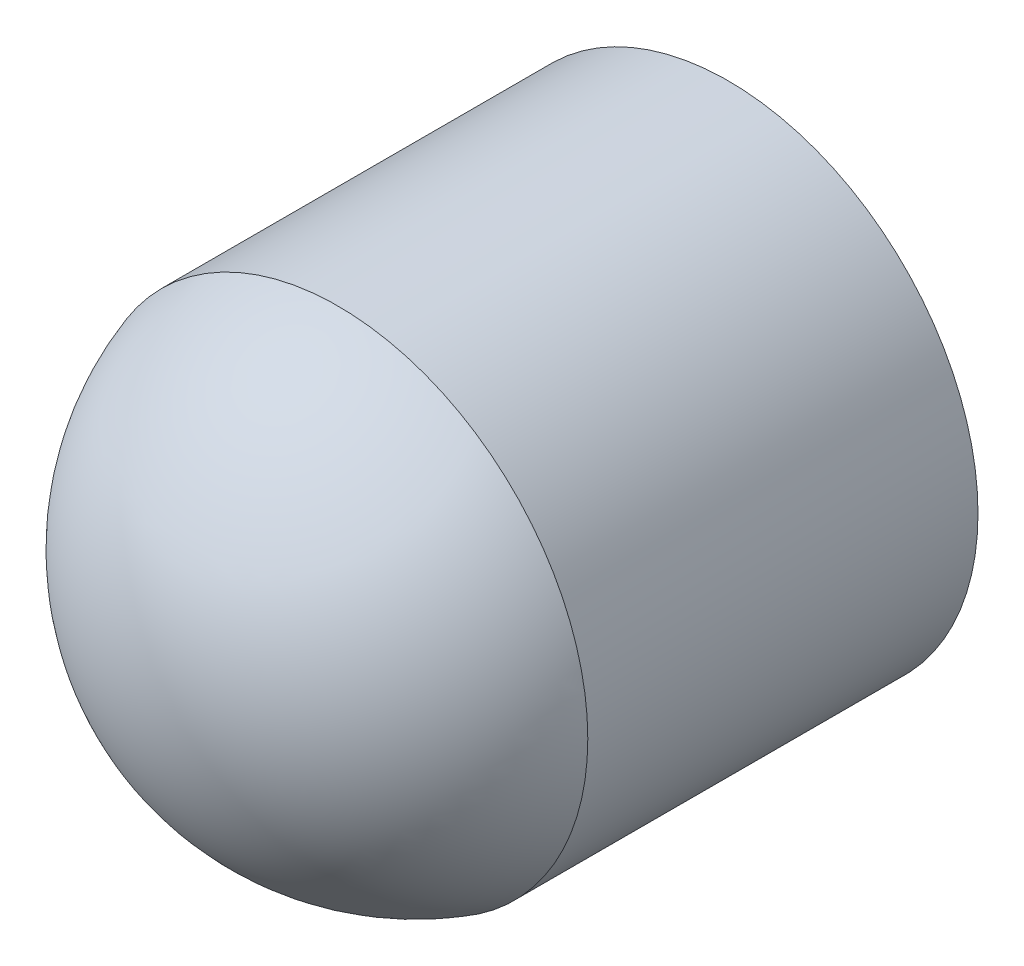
ISO-10303-21;
HEADER;
FILE_DESCRIPTION(('STEP AP214'),'2;1');
FILE_NAME('part.step','',(''),(''),'','','');
FILE_SCHEMA(('AUTOMOTIVE_DESIGN { 1 0 10303 214 1 1 1 1 }'));
ENDSEC;
DATA;
#1=APPLICATION_CONTEXT('core data for automotive mechanical design processes');
#2=APPLICATION_PROTOCOL_DEFINITION('international standard','automotive_design',2000,#1);
#3=PRODUCT_CONTEXT('',#1,'mechanical');
#4=PRODUCT('Part','Part','',(#3));
#5=PRODUCT_RELATED_PRODUCT_CATEGORY('part','',(#4));
#6=PRODUCT_DEFINITION_FORMATION('','',#4);
#7=PRODUCT_DEFINITION_CONTEXT('part definition',#1,'design');
#8=PRODUCT_DEFINITION('design','',#6,#7);
#9=PRODUCT_DEFINITION_SHAPE('','',#8);
#10=(LENGTH_UNIT() NAMED_UNIT(*) SI_UNIT(.MILLI.,.METRE.));
#11=(NAMED_UNIT(*) PLANE_ANGLE_UNIT() SI_UNIT($,.RADIAN.));
#12=(NAMED_UNIT(*) SI_UNIT($,.STERADIAN.) SOLID_ANGLE_UNIT());
#13=UNCERTAINTY_MEASURE_WITH_UNIT(LENGTH_MEASURE(1.E-05),#10,'distance_accuracy_value','');
#14=(GEOMETRIC_REPRESENTATION_CONTEXT(3) GLOBAL_UNCERTAINTY_ASSIGNED_CONTEXT((#13)) GLOBAL_UNIT_ASSIGNED_CONTEXT((#10,
#11,#12)) REPRESENTATION_CONTEXT('',''));
#15=CARTESIAN_POINT('',(0.,0.,0.));
#16=DIRECTION('',(0.,0.,1.));
#17=DIRECTION('',(1.,0.,0.));
#18=AXIS2_PLACEMENT_3D('',#15,#16,#17);
#19=CARTESIAN_POINT('',(0.,0.,-0.716));
#20=DIRECTION('',(0.,0.,1.));
#21=DIRECTION('',(0.,-1.,0.));
#22=AXIS2_PLACEMENT_3D('',#19,#20,#21);
#23=SPHERICAL_SURFACE('',#22,2.2);
#24=CARTESIAN_POINT('',(0.,0.,-0.0602561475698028));
#25=DIRECTION('',(0.,0.,-1.));
#26=DIRECTION('',(-1.,0.,0.));
#27=AXIS2_PLACEMENT_3D('',#24,#25,#26);
#28=CIRCLE('',#27,2.1);
#29=CARTESIAN_POINT('',(2.1,0.,-0.060256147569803));
#30=VERTEX_POINT('',#29);
#31=EDGE_CURVE('E11',#30,#30,#28,.F.);
#32=ORIENTED_EDGE('',*,*,#31,.T.);
#33=EDGE_LOOP('',(#32));
#34=FACE_BOUND('',#33,.T.);
#35=ADVANCED_FACE('F31',(#34),#23,.T.);
#36=CARTESIAN_POINT('',(0.,0.,-3.34084565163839));
#37=DIRECTION('',(0.,0.,1.));
#38=DIRECTION('',(1.,0.,0.));
#39=AXIS2_PLACEMENT_3D('',#36,#37,#38);
#40=CYLINDRICAL_SURFACE('',#39,2.1);
#41=CARTESIAN_POINT('',(0.,0.,-3.34084565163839));
#42=DIRECTION('',(0.,0.,1.));
#43=DIRECTION('',(1.,0.,0.));
#44=AXIS2_PLACEMENT_3D('',#41,#42,#43);
#45=CIRCLE('',#44,2.1);
#46=CARTESIAN_POINT('',(2.1,0.,-3.34084565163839));
#47=VERTEX_POINT('',#46);
#48=EDGE_CURVE('E38',#47,#47,#45,.T.);
#49=CARTESIAN_POINT('',(2.1,0.,-0.060256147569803));
#50=CARTESIAN_POINT('',(2.1,0.,-0.0944289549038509));
#51=CARTESIAN_POINT('',(2.1,0.,-0.128601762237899));
#52=CARTESIAN_POINT('',(2.1,0.,-0.196947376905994));
#53=CARTESIAN_POINT('',(2.1,0.,-0.231120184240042));
#54=CARTESIAN_POINT('',(2.1,0.,-0.299465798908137));
#55=CARTESIAN_POINT('',(2.1,0.,-0.333638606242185));
#56=CARTESIAN_POINT('',(2.1,0.,-0.401984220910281));
#57=CARTESIAN_POINT('',(2.1,0.,-0.436157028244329));
#58=CARTESIAN_POINT('',(2.1,0.,-0.504502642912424));
#59=CARTESIAN_POINT('',(2.1,0.,-0.538675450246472));
#60=CARTESIAN_POINT('',(2.1,0.,-0.607021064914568));
#61=CARTESIAN_POINT('',(2.1,0.,-0.641193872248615));
#62=CARTESIAN_POINT('',(2.1,0.,-0.709539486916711));
#63=CARTESIAN_POINT('',(2.1,0.,-0.743712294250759));
#64=CARTESIAN_POINT('',(2.1,0.,-0.812057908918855));
#65=CARTESIAN_POINT('',(2.1,0.,-0.846230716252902));
#66=CARTESIAN_POINT('',(2.1,0.,-0.914576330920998));
#67=CARTESIAN_POINT('',(2.1,0.,-0.948749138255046));
#68=CARTESIAN_POINT('',(2.1,0.,-1.01709475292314));
#69=CARTESIAN_POINT('',(2.1,0.,-1.05126756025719));
#70=CARTESIAN_POINT('',(2.1,0.,-1.11961317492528));
#71=CARTESIAN_POINT('',(2.1,0.,-1.15378598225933));
#72=CARTESIAN_POINT('',(2.1,0.,-1.22213159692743));
#73=CARTESIAN_POINT('',(2.1,0.,-1.25630440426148));
#74=CARTESIAN_POINT('',(2.1,0.,-1.32465001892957));
#75=CARTESIAN_POINT('',(2.1,0.,-1.35882282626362));
#76=CARTESIAN_POINT('',(2.1,0.,-1.42716844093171));
#77=CARTESIAN_POINT('',(2.1,0.,-1.46134124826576));
#78=CARTESIAN_POINT('',(2.1,0.,-1.52968686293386));
#79=CARTESIAN_POINT('',(2.1,0.,-1.56385967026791));
#80=CARTESIAN_POINT('',(2.1,0.,-1.632205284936));
#81=CARTESIAN_POINT('',(2.1,0.,-1.66637809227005));
#82=CARTESIAN_POINT('',(2.1,0.,-1.73472370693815));
#83=CARTESIAN_POINT('',(2.1,0.,-1.76889651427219));
#84=CARTESIAN_POINT('',(2.1,0.,-1.83724212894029));
#85=CARTESIAN_POINT('',(2.1,0.,-1.87141493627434));
#86=CARTESIAN_POINT('',(2.1,0.,-1.93976055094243));
#87=CARTESIAN_POINT('',(2.1,0.,-1.97393335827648));
#88=CARTESIAN_POINT('',(2.1,0.,-2.04227897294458));
#89=CARTESIAN_POINT('',(2.1,0.,-2.07645178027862));
#90=CARTESIAN_POINT('',(2.1,0.,-2.14479739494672));
#91=CARTESIAN_POINT('',(2.1,0.,-2.17897020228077));
#92=CARTESIAN_POINT('',(2.1,0.,-2.24731581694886));
#93=CARTESIAN_POINT('',(2.1,0.,-2.28148862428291));
#94=CARTESIAN_POINT('',(2.1,0.,-2.34983423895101));
#95=CARTESIAN_POINT('',(2.1,0.,-2.38400704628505));
#96=CARTESIAN_POINT('',(2.1,0.,-2.45235266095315));
#97=CARTESIAN_POINT('',(2.1,0.,-2.4865254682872));
#98=CARTESIAN_POINT('',(2.1,0.,-2.55487108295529));
#99=CARTESIAN_POINT('',(2.1,0.,-2.58904389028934));
#100=CARTESIAN_POINT('',(2.1,0.,-2.65738950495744));
#101=CARTESIAN_POINT('',(2.1,0.,-2.69156231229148));
#102=CARTESIAN_POINT('',(2.1,0.,-2.75990792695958));
#103=CARTESIAN_POINT('',(2.1,0.,-2.79408073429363));
#104=CARTESIAN_POINT('',(2.1,0.,-2.86242634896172));
#105=CARTESIAN_POINT('',(2.1,0.,-2.89659915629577));
#106=CARTESIAN_POINT('',(2.1,0.,-2.96494477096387));
#107=CARTESIAN_POINT('',(2.1,0.,-2.99911757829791));
#108=CARTESIAN_POINT('',(2.1,0.,-3.06746319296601));
#109=CARTESIAN_POINT('',(2.1,0.,-3.10163600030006));
#110=CARTESIAN_POINT('',(2.1,0.,-3.16998161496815));
#111=CARTESIAN_POINT('',(2.1,0.,-3.2041544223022));
#112=CARTESIAN_POINT('',(2.1,0.,-3.2725000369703));
#113=CARTESIAN_POINT('',(2.1,0.,-3.30667284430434));
#114=CARTESIAN_POINT('',(2.1,0.,-3.34084565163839));
#115=B_SPLINE_CURVE_WITH_KNOTS('',3,(#49,#50,#51,#52,#53,#54,#55,#56,#57,#58,#59,#60,#61,#62,
#63,#64,#65,#66,#67,#68,#69,#70,#71,#72,#73,#74,#75,#76,#77,#78,#79,#80,#81,#82,#83,#84,#85,#86,
#87,#88,#89,#90,#91,#92,#93,#94,#95,#96,#97,#98,#99,#100,#101,#102,#103,#104,#105,#106,#107,
#108,#109,#110,#111,#112,#113,#114),.UNSPECIFIED.,.F.,.F.,(4,2,2,2,2,2,2,2,2,2,2,2,2,2,2,2,2,2,
2,2,2,2,2,2,2,2,2,2,2,2,2,2,4),(0.,0.102518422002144,0.205036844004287,0.30755526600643,
0.410073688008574,0.512592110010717,0.61511053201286,0.717628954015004,0.820147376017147,
0.922665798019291,1.02518422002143,1.12770264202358,1.23022106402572,1.33273948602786,
1.43525790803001,1.53777633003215,1.64029475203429,1.74281317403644,1.84533159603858,
1.94785001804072,2.05036844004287,2.15288686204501,2.25540528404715,2.3579237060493,
2.46044212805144,2.56296055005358,2.66547897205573,2.76799739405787,2.87051581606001,
2.97303423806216,3.0755526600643,3.17807108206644,3.28058950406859),.UNSPECIFIED.);
#116=EDGE_CURVE('BSEAM44',#30,#47,#115,.T.);
#117=ORIENTED_EDGE('',*,*,#31,.F.);
#118=ORIENTED_EDGE('',*,*,#48,.T.);
#119=ORIENTED_EDGE('',*,*,#116,.T.);
#120=ORIENTED_EDGE('',*,*,#116,.F.);
#121=EDGE_LOOP('',(#117,#119,#118,#120));
#122=FACE_BOUND('',#121,.T.);
#123=ADVANCED_FACE('F44',(#122),#40,.T.);
#124=CARTESIAN_POINT('',(0.,-2.2,-3.34084565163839));
#125=DIRECTION('',(0.,0.,-1.));
#126=DIRECTION('',(-1.,0.,0.));
#127=AXIS2_PLACEMENT_3D('',#124,#125,#126);
#128=PLANE('',#127);
#129=ORIENTED_EDGE('',*,*,#48,.F.);
#130=EDGE_LOOP('',(#129));
#131=FACE_BOUND('',#130,.T.);
#132=ADVANCED_FACE('F33',(#131),#128,.T.);
#133=CLOSED_SHELL('',(#35,#123,#132));
#134=MANIFOLD_SOLID_BREP('B2',#133);
#135=ADVANCED_BREP_SHAPE_REPRESENTATION('',(#18,#134),#14);
#136=SHAPE_DEFINITION_REPRESENTATION(#9,#135);
ENDSEC;
END-ISO-10303-21;
